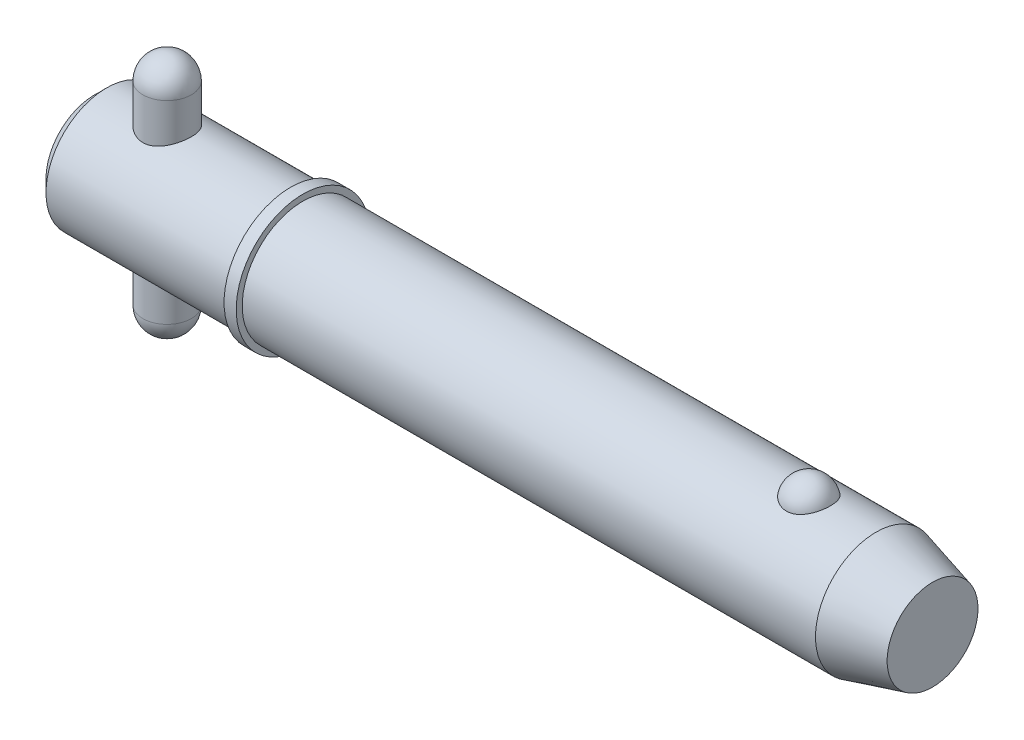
ISO-10303-21;
HEADER;
FILE_DESCRIPTION(('STEP AP214'),'2;1');
FILE_NAME('part.step','',(''),(''),'','','');
FILE_SCHEMA(('AUTOMOTIVE_DESIGN { 1 0 10303 214 1 1 1 1 }'));
ENDSEC;
DATA;
#1=APPLICATION_CONTEXT('core data for automotive mechanical design processes');
#2=APPLICATION_PROTOCOL_DEFINITION('international standard','automotive_design',2000,#1);
#3=PRODUCT_CONTEXT('',#1,'mechanical');
#4=PRODUCT('Part','Part','',(#3));
#5=PRODUCT_RELATED_PRODUCT_CATEGORY('part','',(#4));
#6=PRODUCT_DEFINITION_FORMATION('','',#4);
#7=PRODUCT_DEFINITION_CONTEXT('part definition',#1,'design');
#8=PRODUCT_DEFINITION('design','',#6,#7);
#9=PRODUCT_DEFINITION_SHAPE('','',#8);
#10=(LENGTH_UNIT() NAMED_UNIT(*) SI_UNIT(.MILLI.,.METRE.));
#11=(NAMED_UNIT(*) PLANE_ANGLE_UNIT() SI_UNIT($,.RADIAN.));
#12=(NAMED_UNIT(*) SI_UNIT($,.STERADIAN.) SOLID_ANGLE_UNIT());
#13=UNCERTAINTY_MEASURE_WITH_UNIT(LENGTH_MEASURE(1.E-05),#10,'distance_accuracy_value','');
#14=(GEOMETRIC_REPRESENTATION_CONTEXT(3) GLOBAL_UNCERTAINTY_ASSIGNED_CONTEXT((#13)) GLOBAL_UNIT_ASSIGNED_CONTEXT((#10,
#11,#12)) REPRESENTATION_CONTEXT('',''));
#15=CARTESIAN_POINT('',(0.,0.,0.));
#16=DIRECTION('',(0.,0.,1.));
#17=DIRECTION('',(1.,0.,0.));
#18=AXIS2_PLACEMENT_3D('',#15,#16,#17);
#19=CARTESIAN_POINT('',(9.525,15.875,0.));
#20=DIRECTION('',(0.,-1.,0.));
#21=DIRECTION('',(0.,0.,-1.));
#22=AXIS2_PLACEMENT_3D('',#19,#20,#21);
#23=CYLINDRICAL_SURFACE('',#22,3.175);
#24=CARTESIAN_POINT('',(9.525,-12.7,0.));
#25=DIRECTION('',(0.,-1.,0.));
#26=DIRECTION('',(0.,0.,-1.));
#27=AXIS2_PLACEMENT_3D('',#24,#25,#26);
#28=CIRCLE('',#27,3.175);
#29=CARTESIAN_POINT('',(9.525,-12.7,-3.175));
#30=VERTEX_POINT('',#29);
#31=EDGE_CURVE('P0_E10',#30,#30,#28,.F.);
#32=ORIENTED_EDGE('',*,*,#31,.T.);
#33=EDGE_LOOP('',(#32));
#34=FACE_BOUND('',#33,.T.);
#35=CARTESIAN_POINT('',(9.525,12.7,0.));
#36=DIRECTION('',(0.,-1.,0.));
#37=DIRECTION('',(0.,0.,-1.));
#38=AXIS2_PLACEMENT_3D('',#35,#36,#37);
#39=CIRCLE('',#38,3.175);
#40=CARTESIAN_POINT('',(9.525,12.7,-3.175));
#41=VERTEX_POINT('',#40);
#42=EDGE_CURVE('P0_E21',#41,#41,#39,.T.);
#43=ORIENTED_EDGE('',*,*,#42,.T.);
#44=EDGE_LOOP('',(#43));
#45=FACE_BOUND('',#44,.T.);
#46=ADVANCED_FACE('P0_F14',(#34,#45),#23,.T.);
#47=CARTESIAN_POINT('',(9.525,-12.7,0.));
#48=DIRECTION('',(0.,0.,1.));
#49=DIRECTION('',(1.,0.,0.));
#50=AXIS2_PLACEMENT_3D('',#47,#48,#49);
#51=SPHERICAL_SURFACE('',#50,3.175);
#52=CARTESIAN_POINT('',(9.525,-12.7,0.));
#53=DIRECTION('',(0.,-1.,0.));
#54=DIRECTION('',(0.,0.,-1.));
#55=AXIS2_PLACEMENT_3D('',#52,#53,#54);
#56=SPHERICAL_SURFACE('',#55,3.175);
#57=ORIENTED_EDGE('',*,*,#31,.F.);
#58=EDGE_LOOP('',(#57));
#59=FACE_BOUND('',#58,.T.);
#60=ADVANCED_FACE('P0_F29',(#59),#56,.T.);
#61=CARTESIAN_POINT('',(9.525,12.7,0.));
#62=DIRECTION('',(0.,0.,1.));
#63=DIRECTION('',(1.,0.,0.));
#64=AXIS2_PLACEMENT_3D('',#61,#62,#63);
#65=SPHERICAL_SURFACE('',#64,3.175);
#66=CARTESIAN_POINT('',(9.525,12.7,0.));
#67=DIRECTION('',(0.,-1.,0.));
#68=DIRECTION('',(0.,0.,-1.));
#69=AXIS2_PLACEMENT_3D('',#66,#67,#68);
#70=SPHERICAL_SURFACE('',#69,3.175);
#71=ORIENTED_EDGE('',*,*,#42,.F.);
#72=EDGE_LOOP('',(#71));
#73=FACE_BOUND('',#72,.T.);
#74=ADVANCED_FACE('P0_F16',(#73),#70,.T.);
#75=CLOSED_SHELL('',(#46,#60,#74));
#76=MANIFOLD_SOLID_BREP('P0_B1',#75);
#77=CARTESIAN_POINT('',(0.,0.,0.));
#78=DIRECTION('',(1.,0.,0.));
#79=DIRECTION('',(0.,0.,-1.));
#80=AXIS2_PLACEMENT_3D('',#77,#78,#79);
#81=CYLINDRICAL_SURFACE('',#80,7.94);
#82=CARTESIAN_POINT('',(102.451879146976,0.,0.));
#83=DIRECTION('',(1.,0.,0.));
#84=DIRECTION('',(0.,0.,-1.));
#85=AXIS2_PLACEMENT_3D('',#82,#83,#84);
#86=CIRCLE('',#85,7.94);
#87=CARTESIAN_POINT('',(102.451879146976,0.,-7.94));
#88=VERTEX_POINT('',#87);
#89=EDGE_CURVE('P1_E81',#88,#88,#86,.T.);
#90=ORIENTED_EDGE('',*,*,#89,.F.);
#91=EDGE_LOOP('',(#90));
#92=FACE_BOUND('',#91,.T.);
#93=CARTESIAN_POINT('',(27.31,0.,0.));
#94=DIRECTION('',(1.,0.,0.));
#95=DIRECTION('',(0.,0.,-1.));
#96=AXIS2_PLACEMENT_3D('',#93,#94,#95);
#97=CIRCLE('',#96,7.94);
#98=CARTESIAN_POINT('',(27.31,0.,-7.94));
#99=VERTEX_POINT('',#98);
#100=EDGE_CURVE('P1_E85',#99,#99,#97,.T.);
#101=ORIENTED_EDGE('',*,*,#100,.T.);
#102=EDGE_LOOP('',(#101));
#103=FACE_BOUND('',#102,.T.);
#104=CARTESIAN_POINT('',(93.6449074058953,7.37767842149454,2.93486986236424));
#105=CARTESIAN_POINT('',(93.4927496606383,7.37767329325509,2.9348750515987));
#106=CARTESIAN_POINT('',(93.3406329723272,7.38258419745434,2.92262454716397));
#107=CARTESIAN_POINT('',(93.0409284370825,7.40163229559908,2.87404196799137));
#108=CARTESIAN_POINT('',(92.8933394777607,7.41576720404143,2.83771585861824));
#109=CARTESIAN_POINT('',(92.6070187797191,7.45161576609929,2.74218769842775));
#110=CARTESIAN_POINT('',(92.4682745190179,7.47331841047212,2.68301886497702));
#111=CARTESIAN_POINT('',(92.2028822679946,7.52194082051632,2.54350967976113));
#112=CARTESIAN_POINT('',(92.0762366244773,7.54886159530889,2.46316523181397));
#113=CARTESIAN_POINT('',(91.8345349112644,7.60594671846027,2.28090375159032));
#114=CARTESIAN_POINT('',(91.7199065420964,7.63618114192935,2.1784421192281));
#115=CARTESIAN_POINT('',(91.5088787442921,7.69614046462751,1.95608495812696));
#116=CARTESIAN_POINT('',(91.4124826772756,7.72586526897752,1.83618622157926));
#117=CARTESIAN_POINT('',(91.2359381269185,7.78314821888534,1.57628086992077));
#118=CARTESIAN_POINT('',(91.1567072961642,7.81055035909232,1.43561546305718));
#119=CARTESIAN_POINT('',(91.0217979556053,7.85879631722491,1.14236334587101));
#120=CARTESIAN_POINT('',(90.9661216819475,7.87963951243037,0.98977550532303));
#121=CARTESIAN_POINT('',(90.8788121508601,7.91289645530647,0.674619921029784));
#122=CARTESIAN_POINT('',(90.8475309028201,7.92518652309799,0.511941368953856));
#123=CARTESIAN_POINT('',(90.8109756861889,7.93958930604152,0.18324773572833));
#124=CARTESIAN_POINT('',(90.8057012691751,7.94170219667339,0.0172327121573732));
#125=CARTESIAN_POINT('',(90.8212311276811,7.93554931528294,-0.312672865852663));
#126=CARTESIAN_POINT('',(90.8419253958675,7.92732732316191,-0.476569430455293));
#127=CARTESIAN_POINT('',(90.9087865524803,7.90141534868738,-0.798305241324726));
#128=CARTESIAN_POINT('',(90.9549539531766,7.88372517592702,-0.95614436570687));
#129=CARTESIAN_POINT('',(91.0718986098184,7.84066230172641,-1.26152073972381));
#130=CARTESIAN_POINT('',(91.1427046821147,7.81528060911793,-1.40904568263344));
#131=CARTESIAN_POINT('',(91.3074789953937,7.7594867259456,-1.68950598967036));
#132=CARTESIAN_POINT('',(91.4014488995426,7.72907417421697,-1.82244030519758));
#133=CARTESIAN_POINT('',(91.6108391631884,7.66640424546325,-2.07032792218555));
#134=CARTESIAN_POINT('',(91.7263152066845,7.63414223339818,-2.1852330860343));
#135=CARTESIAN_POINT('',(91.9759006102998,7.57149681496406,-2.39329737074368));
#136=CARTESIAN_POINT('',(92.1100080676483,7.54111321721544,-2.48645870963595));
#137=CARTESIAN_POINT('',(92.3901113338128,7.48650742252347,-2.64628132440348));
#138=CARTESIAN_POINT('',(92.5357605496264,7.46215900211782,-2.71350554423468));
#139=CARTESIAN_POINT('',(92.8374259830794,7.42171253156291,-2.82226614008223));
#140=CARTESIAN_POINT('',(92.9934383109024,7.40561140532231,-2.86381209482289));
#141=CARTESIAN_POINT('',(93.3029708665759,7.3842679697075,-2.91839077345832));
#142=CARTESIAN_POINT('',(93.4562229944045,7.37852109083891,-2.93275024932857));
#143=CARTESIAN_POINT('',(93.7630705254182,7.37700973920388,-2.93655208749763));
#144=CARTESIAN_POINT('',(93.9166658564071,7.38124333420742,-2.92599927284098));
#145=CARTESIAN_POINT('',(94.2149907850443,7.39890635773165,-2.88102897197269));
#146=CARTESIAN_POINT('',(94.3598480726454,7.41205491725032,-2.84733999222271));
#147=CARTESIAN_POINT('',(94.6416432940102,7.44580110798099,-2.75788206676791));
#148=CARTESIAN_POINT('',(94.7785805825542,7.46639934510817,-2.70211132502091));
#149=CARTESIAN_POINT('',(95.0440619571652,7.51339098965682,-2.56858908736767));
#150=CARTESIAN_POINT('',(95.1723548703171,7.5399020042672,-2.49038067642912));
#151=CARTESIAN_POINT('',(95.4142440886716,7.59569503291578,-2.31462737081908));
#152=CARTESIAN_POINT('',(95.5278370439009,7.6249776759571,-2.21707808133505));
#153=CARTESIAN_POINT('',(95.74322156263,7.68489473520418,-1.99982049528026));
#154=CARTESIAN_POINT('',(95.8441488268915,7.71552419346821,-1.87925337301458));
#155=CARTESIAN_POINT('',(96.0251866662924,7.77353016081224,-1.62268826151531));
#156=CARTESIAN_POINT('',(96.1052934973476,7.80090608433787,-1.48668750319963));
#157=CARTESIAN_POINT('',(96.2453615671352,7.85047992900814,-1.19818413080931));
#158=CARTESIAN_POINT('',(96.3045877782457,7.87248183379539,-1.04529016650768));
#159=CARTESIAN_POINT('',(96.3979821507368,7.90785114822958,-0.731080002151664));
#160=CARTESIAN_POINT('',(96.4321497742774,7.92121837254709,-0.569763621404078));
#161=CARTESIAN_POINT('',(96.474795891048,7.93797834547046,-0.24281228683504));
#162=CARTESIAN_POINT('',(96.4832047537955,7.94134405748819,-0.0771668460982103));
#163=CARTESIAN_POINT('',(96.4739626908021,7.93767937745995,0.253276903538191));
#164=CARTESIAN_POINT('',(96.4563120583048,7.93064910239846,0.418075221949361));
#165=CARTESIAN_POINT('',(96.395424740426,7.90695571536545,0.74152553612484));
#166=CARTESIAN_POINT('',(96.3522819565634,7.8903279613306,0.900197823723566));
#167=CARTESIAN_POINT('',(96.2413535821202,7.84916386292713,1.20759654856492));
#168=CARTESIAN_POINT('',(96.17356656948,7.82462706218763,1.35632241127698));
#169=CARTESIAN_POINT('',(96.0143718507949,7.7700669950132,1.64032869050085));
#170=CARTESIAN_POINT('',(95.9228616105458,7.74002008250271,1.7755471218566));
#171=CARTESIAN_POINT('',(95.7182960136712,7.67774175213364,2.02800648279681));
#172=CARTESIAN_POINT('',(95.6052410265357,7.64551037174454,2.14524772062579));
#173=CARTESIAN_POINT('',(95.3608318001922,7.58265895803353,2.35778002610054));
#174=CARTESIAN_POINT('',(95.2295833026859,7.55203092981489,2.45319004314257));
#175=CARTESIAN_POINT('',(94.951601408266,7.49579792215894,2.61999897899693));
#176=CARTESIAN_POINT('',(94.8048670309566,7.47019326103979,2.69139637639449));
#177=CARTESIAN_POINT('',(94.4929477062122,7.42622216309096,2.81053241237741));
#178=CARTESIAN_POINT('',(94.3272209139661,7.40825002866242,2.85700910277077));
#179=CARTESIAN_POINT('',(93.9892792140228,7.38398348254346,2.91916850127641));
#180=CARTESIAN_POINT('',(93.8170670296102,7.37768422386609,2.93486399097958));
#181=CARTESIAN_POINT('',(93.6449074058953,7.37767842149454,2.93486986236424));
#182=B_SPLINE_CURVE_WITH_KNOTS('',3,(#104,#105,#106,#107,#108,#109,#110,#111,#112,#113,#114,
#115,#116,#117,#118,#119,#120,#121,#122,#123,#124,#125,#126,#127,#128,#129,#130,#131,#132,#133,
#134,#135,#136,#137,#138,#139,#140,#141,#142,#143,#144,#145,#146,#147,#148,#149,#150,#151,#152,
#153,#154,#155,#156,#157,#158,#159,#160,#161,#162,#163,#164,#165,#166,#167,#168,#169,#170,#171,
#172,#173,#174,#175,#176,#177,#178,#179,#180,#181),.UNSPECIFIED.,.T.,.F.,(4,2,2,2,2,2,2,2,2,2,2,
2,2,2,2,2,2,2,2,2,2,2,2,2,2,2,2,2,2,2,2,2,2,2,2,2,2,2,4),(0.,0.455841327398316,
0.911569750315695,1.36663794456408,1.82179423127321,2.28978983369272,2.75787163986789,
3.24685368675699,3.73588214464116,4.23184282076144,4.72779494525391,5.22165321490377,
5.71552141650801,6.20996917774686,6.70445245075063,7.200234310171,7.69596557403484,
8.18023418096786,8.66432203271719,9.12410697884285,9.58380291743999,10.0296503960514,
10.475534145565,10.9312349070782,11.3870393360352,11.8654416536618,12.3439299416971,
12.8378875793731,13.3318558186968,13.8271581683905,14.3224549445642,14.8159385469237,
15.3094506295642,15.8051323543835,16.3008055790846,16.7937101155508,17.2866458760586,
17.8026240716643,18.3183879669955),.UNSPECIFIED.);
#183=CARTESIAN_POINT('',(93.6449074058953,7.37767842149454,2.93486986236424));
#184=VERTEX_POINT('',#183);
#185=EDGE_CURVE('P1_E35',#184,#184,#182,.T.);
#186=ORIENTED_EDGE('',*,*,#185,.T.);
#187=EDGE_LOOP('',(#186));
#188=FACE_BOUND('',#187,.T.);
#189=ADVANCED_FACE('P1_F13',(#92,#103,#188),#81,.T.);
#190=CARTESIAN_POINT('',(0.,0.,0.));
#191=DIRECTION('',(-1.,0.,0.));
#192=DIRECTION('',(0.,0.,1.));
#193=AXIS2_PLACEMENT_3D('',#190,#191,#192);
#194=PLANE('',#193);
#195=CARTESIAN_POINT('',(0.,0.,0.));
#196=DIRECTION('',(1.,0.,0.));
#197=DIRECTION('',(0.,0.,-1.));
#198=AXIS2_PLACEMENT_3D('',#195,#196,#197);
#199=CIRCLE('',#198,6.352);
#200=CARTESIAN_POINT('',(0.,0.,-6.352));
#201=VERTEX_POINT('',#200);
#202=EDGE_CURVE('P1_E9',#201,#201,#199,.T.);
#203=ORIENTED_EDGE('',*,*,#202,.F.);
#204=EDGE_LOOP('',(#203));
#205=FACE_BOUND('',#204,.T.);
#206=ADVANCED_FACE('P1_F15',(#205),#194,.T.);
#207=CARTESIAN_POINT('',(1.58799999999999,0.,0.));
#208=DIRECTION('',(1.,0.,0.));
#209=DIRECTION('',(0.,0.,-1.));
#210=AXIS2_PLACEMENT_3D('',#207,#208,#209);
#211=CONICAL_SURFACE('',#210,7.94,0.78539816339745);
#212=ORIENTED_EDGE('',*,*,#202,.T.);
#213=EDGE_LOOP('',(#212));
#214=FACE_BOUND('',#213,.T.);
#215=CARTESIAN_POINT('',(1.58799999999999,0.,0.));
#216=DIRECTION('',(1.,0.,0.));
#217=DIRECTION('',(0.,0.,-1.));
#218=AXIS2_PLACEMENT_3D('',#215,#216,#217);
#219=CIRCLE('',#218,7.94);
#220=CARTESIAN_POINT('',(1.58799999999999,0.,-7.94));
#221=VERTEX_POINT('',#220);
#222=EDGE_CURVE('P1_E26',#221,#221,#219,.T.);
#223=ORIENTED_EDGE('',*,*,#222,.F.);
#224=EDGE_LOOP('',(#223));
#225=FACE_BOUND('',#224,.T.);
#226=ADVANCED_FACE('P1_F77',(#214,#225),#211,.T.);
#227=CARTESIAN_POINT('',(0.,0.,0.));
#228=DIRECTION('',(1.,0.,0.));
#229=DIRECTION('',(0.,0.,-1.));
#230=AXIS2_PLACEMENT_3D('',#227,#228,#229);
#231=CYLINDRICAL_SURFACE('',#230,7.94);
#232=CARTESIAN_POINT('',(9.525,-7.27756655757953,3.175));
#233=CARTESIAN_POINT('',(9.43992346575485,-7.27756715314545,3.17499935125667));
#234=CARTESIAN_POINT('',(9.35481882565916,-7.27906496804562,3.1715736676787));
#235=CARTESIAN_POINT('',(9.18524505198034,-7.28499816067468,3.15791803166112));
#236=CARTESIAN_POINT('',(9.100776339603,-7.28943533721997,3.14768391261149));
#237=CARTESIAN_POINT('',(8.84895715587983,-7.30698881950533,3.10684226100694));
#238=CARTESIAN_POINT('',(8.6834173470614,-7.32434654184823,3.06609574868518));
#239=CARTESIAN_POINT('',(8.36278910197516,-7.36806950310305,2.95945910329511));
#240=CARTESIAN_POINT('',(8.20766386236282,-7.39440078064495,2.89366366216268));
#241=CARTESIAN_POINT('',(7.91065319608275,-7.45304562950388,2.73907413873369));
#242=CARTESIAN_POINT('',(7.76876488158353,-7.48535789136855,2.65028508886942));
#243=CARTESIAN_POINT('',(7.49411086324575,-7.55439482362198,2.44679888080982));
#244=CARTESIAN_POINT('',(7.36219910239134,-7.59126138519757,2.33099745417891));
#245=CARTESIAN_POINT('',(7.11904234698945,-7.66408045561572,2.07909838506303));
#246=CARTESIAN_POINT('',(7.00780457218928,-7.70003264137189,1.94299368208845));
#247=CARTESIAN_POINT('',(6.80492173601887,-7.76867514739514,1.64775981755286));
#248=CARTESIAN_POINT('',(6.71422139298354,-7.80118112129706,1.48793473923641));
#249=CARTESIAN_POINT('',(6.56135788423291,-7.85754918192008,1.15376269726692));
#250=CARTESIAN_POINT('',(6.49918311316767,-7.88141478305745,0.979421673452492));
#251=CARTESIAN_POINT('',(6.40818142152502,-7.91680873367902,0.630115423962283));
#252=CARTESIAN_POINT('',(6.3778864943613,-7.9288781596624,0.455588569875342));
#253=CARTESIAN_POINT('',(6.34677743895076,-7.94127547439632,0.103539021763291));
#254=CARTESIAN_POINT('',(6.34595232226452,-7.94160773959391,-0.0739825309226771));
#255=CARTESIAN_POINT('',(6.37300128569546,-7.93082261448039,-0.416371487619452));
#256=CARTESIAN_POINT('',(6.39926693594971,-7.92034690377,-0.581389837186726));
#257=CARTESIAN_POINT('',(6.47701615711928,-7.88998770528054,-0.904449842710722));
#258=CARTESIAN_POINT('',(6.52850157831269,-7.87010352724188,-1.06249098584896));
#259=CARTESIAN_POINT('',(6.65586120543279,-7.82249343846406,-1.36995769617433));
#260=CARTESIAN_POINT('',(6.73209124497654,-7.79465387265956,-1.51921754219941));
#261=CARTESIAN_POINT('',(6.90644286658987,-7.73389606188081,-1.80321183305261));
#262=CARTESIAN_POINT('',(7.00457194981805,-7.70097607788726,-1.93794127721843));
#263=CARTESIAN_POINT('',(7.22744086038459,-7.63084889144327,-2.19843606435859));
#264=CARTESIAN_POINT('',(7.35350432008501,-7.59350211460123,-2.3230330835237));
#265=CARTESIAN_POINT('',(7.62488266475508,-7.52039654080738,-2.54979642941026));
#266=CARTESIAN_POINT('',(7.77020381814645,-7.48463826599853,-2.65195542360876));
#267=CARTESIAN_POINT('',(8.08119298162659,-7.41780943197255,-2.83361305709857));
#268=CARTESIAN_POINT('',(8.24731937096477,-7.38689959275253,-2.91239105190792));
#269=CARTESIAN_POINT('',(8.59204539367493,-7.33515216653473,-3.04038913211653));
#270=CARTESIAN_POINT('',(8.77063684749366,-7.31430804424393,-3.08962840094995));
#271=CARTESIAN_POINT('',(9.12356982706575,-7.28663831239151,-3.15431018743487));
#272=CARTESIAN_POINT('',(9.29750494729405,-7.2790344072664,-3.17163284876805));
#273=CARTESIAN_POINT('',(9.64592502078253,-7.27648884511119,-3.17747282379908));
#274=CARTESIAN_POINT('',(9.82040979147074,-7.28154335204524,-3.16599886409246));
#275=CARTESIAN_POINT('',(10.1545374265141,-7.30294638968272,-3.11628310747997));
#276=CARTESIAN_POINT('',(10.3144598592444,-7.31863587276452,-3.0796016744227));
#277=CARTESIAN_POINT('',(10.625774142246,-7.35872371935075,-2.98253618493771));
#278=CARTESIAN_POINT('',(10.7771640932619,-7.38312401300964,-2.92214687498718));
#279=CARTESIAN_POINT('',(11.0739599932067,-7.4390944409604,-2.77664664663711));
#280=CARTESIAN_POINT('',(11.2188745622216,-7.47091513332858,-2.69063278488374));
#281=CARTESIAN_POINT('',(11.4928722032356,-7.53775867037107,-2.49724834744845));
#282=CARTESIAN_POINT('',(11.6219487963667,-7.57278281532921,-2.38986907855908));
#283=CARTESIAN_POINT('',(11.8705091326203,-7.64520845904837,-2.1474449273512));
#284=CARTESIAN_POINT('',(11.9885816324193,-7.68259462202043,-2.01094304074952));
#285=CARTESIAN_POINT('',(12.2003631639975,-7.75309951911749,-1.71917041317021));
#286=CARTESIAN_POINT('',(12.2940712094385,-7.78621808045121,-1.56389891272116));
#287=CARTESIAN_POINT('',(12.4541161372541,-7.84456050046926,-1.23845027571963));
#288=CARTESIAN_POINT('',(12.5204600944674,-7.86978639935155,-1.06827700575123));
#289=CARTESIAN_POINT('',(12.6231407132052,-7.90943635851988,-0.717928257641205));
#290=CARTESIAN_POINT('',(12.6594936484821,-7.92386627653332,-0.537758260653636));
#291=CARTESIAN_POINT('',(12.6992281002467,-7.93967263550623,-0.185201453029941));
#292=CARTESIAN_POINT('',(12.7046050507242,-7.94183891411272,-0.0130732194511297));
#293=CARTESIAN_POINT('',(12.6875036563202,-7.9350072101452,0.329549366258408));
#294=CARTESIAN_POINT('',(12.6650295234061,-7.92601091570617,0.500043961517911));
#295=CARTESIAN_POINT('',(12.5942896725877,-7.89825976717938,0.829196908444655));
#296=CARTESIAN_POINT('',(12.5468364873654,-7.87981280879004,0.988057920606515));
#297=CARTESIAN_POINT('',(12.4283390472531,-7.83513565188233,1.29553461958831));
#298=CARTESIAN_POINT('',(12.3572904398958,-7.8089040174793,1.44414841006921));
#299=CARTESIAN_POINT('',(12.1900822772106,-7.7497911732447,1.73412879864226));
#300=CARTESIAN_POINT('',(12.0929519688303,-7.71666737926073,1.87488510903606));
#301=CARTESIAN_POINT('',(11.8777894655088,-7.64775894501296,2.13869231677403));
#302=CARTESIAN_POINT('',(11.7597486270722,-7.61197320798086,2.26173585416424));
#303=CARTESIAN_POINT('',(11.4974896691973,-7.53902341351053,2.49449755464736));
#304=CARTESIAN_POINT('',(11.3521039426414,-7.50191102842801,2.60292060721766));
#305=CARTESIAN_POINT('',(11.0440201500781,-7.43289551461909,2.79392602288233));
#306=CARTESIAN_POINT('',(10.8813200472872,-7.40099299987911,2.87650534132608));
#307=CARTESIAN_POINT('',(10.558064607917,-7.3489506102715,3.00682739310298));
#308=CARTESIAN_POINT('',(10.398627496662,-7.32801197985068,3.05703164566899));
#309=CARTESIAN_POINT('',(10.0731242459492,-7.29639491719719,3.13175843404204));
#310=CARTESIAN_POINT('',(9.90707793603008,-7.28568789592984,3.15635254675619));
#311=CARTESIAN_POINT('',(9.70441566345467,-7.27968826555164,3.17013149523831));
#312=CARTESIAN_POINT('',(9.66856669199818,-7.27889378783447,3.17195593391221));
#313=CARTESIAN_POINT('',(9.59681348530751,-7.27783278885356,3.17439036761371));
#314=CARTESIAN_POINT('',(9.56090924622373,-7.27756630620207,3.17500027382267));
#315=CARTESIAN_POINT('',(9.525,-7.27756655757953,3.175));
#316=B_SPLINE_CURVE_WITH_KNOTS('',3,(#232,#233,#234,#235,#236,#237,#238,#239,#240,#241,#242,
#243,#244,#245,#246,#247,#248,#249,#250,#251,#252,#253,#254,#255,#256,#257,#258,#259,#260,#261,
#262,#263,#264,#265,#266,#267,#268,#269,#270,#271,#272,#273,#274,#275,#276,#277,#278,#279,#280,
#281,#282,#283,#284,#285,#286,#287,#288,#289,#290,#291,#292,#293,#294,#295,#296,#297,#298,#299,
#300,#301,#302,#303,#304,#305,#306,#307,#308,#309,#310,#311,#312,#313,#314,#315),.UNSPECIFIED.,
.T.,.F.,(4,2,2,2,2,2,2,2,2,2,2,2,2,2,2,2,2,2,2,2,2,2,2,2,2,2,2,2,2,2,2,2,2,2,2,2,2,2,2,2,2,4),
(0.,0.255187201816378,0.510530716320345,1.0218798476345,1.53131482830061,2.04063840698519,
2.57635929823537,3.11226692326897,3.66929090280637,4.22608806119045,4.75594400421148,
5.28560237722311,5.78552836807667,6.28549104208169,6.79298787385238,7.30065880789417,
7.8416422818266,8.38280228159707,8.93923025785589,9.49529647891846,10.0174074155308,
10.5393601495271,11.0316114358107,11.5239718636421,12.0362920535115,12.5488211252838,
13.0991799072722,13.6495609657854,14.1997996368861,14.7497395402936,15.2638187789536,
15.7778202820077,16.2760504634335,16.7743726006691,17.294711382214,17.8152657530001,
18.3680208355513,18.9208410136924,19.4240423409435,19.9258334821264,20.0335354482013,
20.1412452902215),.UNSPECIFIED.);
#317=CARTESIAN_POINT('',(9.525,-7.27756655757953,3.175));
#318=VERTEX_POINT('',#317);
#319=EDGE_CURVE('P1_E17',#318,#318,#316,.T.);
#320=ORIENTED_EDGE('',*,*,#319,.F.);
#321=EDGE_LOOP('',(#320));
#322=FACE_BOUND('',#321,.T.);
#323=CARTESIAN_POINT('',(9.525,7.27756655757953,3.175));
#324=CARTESIAN_POINT('',(9.61007653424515,7.27756715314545,3.17499935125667));
#325=CARTESIAN_POINT('',(9.69518117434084,7.27906496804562,3.1715736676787));
#326=CARTESIAN_POINT('',(9.86475494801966,7.28499816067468,3.15791803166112));
#327=CARTESIAN_POINT('',(9.949223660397,7.28943533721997,3.14768391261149));
#328=CARTESIAN_POINT('',(10.2010428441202,7.30698881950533,3.10684226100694));
#329=CARTESIAN_POINT('',(10.3665826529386,7.32434654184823,3.06609574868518));
#330=CARTESIAN_POINT('',(10.6872108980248,7.36806950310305,2.95945910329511));
#331=CARTESIAN_POINT('',(10.8423361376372,7.39440078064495,2.89366366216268));
#332=CARTESIAN_POINT('',(11.1393468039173,7.45304562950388,2.73907413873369));
#333=CARTESIAN_POINT('',(11.2812351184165,7.48535789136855,2.65028508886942));
#334=CARTESIAN_POINT('',(11.5558891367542,7.55439482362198,2.44679888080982));
#335=CARTESIAN_POINT('',(11.6878008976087,7.59126138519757,2.33099745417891));
#336=CARTESIAN_POINT('',(11.9309576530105,7.66408045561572,2.07909838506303));
#337=CARTESIAN_POINT('',(12.0421954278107,7.70003264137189,1.94299368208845));
#338=CARTESIAN_POINT('',(12.2450782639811,7.76867514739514,1.64775981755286));
#339=CARTESIAN_POINT('',(12.3357786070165,7.80118112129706,1.48793473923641));
#340=CARTESIAN_POINT('',(12.4886421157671,7.85754918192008,1.15376269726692));
#341=CARTESIAN_POINT('',(12.5508168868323,7.88141478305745,0.979421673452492));
#342=CARTESIAN_POINT('',(12.641818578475,7.91680873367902,0.630115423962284));
#343=CARTESIAN_POINT('',(12.6721135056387,7.9288781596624,0.455588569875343));
#344=CARTESIAN_POINT('',(12.7032225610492,7.94127547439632,0.103539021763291));
#345=CARTESIAN_POINT('',(12.7040476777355,7.94160773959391,-0.0739825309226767));
#346=CARTESIAN_POINT('',(12.6769987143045,7.93082261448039,-0.416371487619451));
#347=CARTESIAN_POINT('',(12.6507330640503,7.92034690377,-0.581389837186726));
#348=CARTESIAN_POINT('',(12.5729838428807,7.88998770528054,-0.904449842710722));
#349=CARTESIAN_POINT('',(12.5214984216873,7.87010352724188,-1.06249098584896));
#350=CARTESIAN_POINT('',(12.3941387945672,7.82249343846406,-1.36995769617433));
#351=CARTESIAN_POINT('',(12.3179087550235,7.79465387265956,-1.51921754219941));
#352=CARTESIAN_POINT('',(12.1435571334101,7.73389606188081,-1.80321183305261));
#353=CARTESIAN_POINT('',(12.0454280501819,7.70097607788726,-1.93794127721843));
#354=CARTESIAN_POINT('',(11.8225591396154,7.63084889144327,-2.19843606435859));
#355=CARTESIAN_POINT('',(11.696495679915,7.59350211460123,-2.3230330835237));
#356=CARTESIAN_POINT('',(11.4251173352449,7.52039654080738,-2.54979642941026));
#357=CARTESIAN_POINT('',(11.2797961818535,7.48463826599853,-2.65195542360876));
#358=CARTESIAN_POINT('',(10.9688070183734,7.41780943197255,-2.83361305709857));
#359=CARTESIAN_POINT('',(10.8026806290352,7.38689959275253,-2.91239105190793));
#360=CARTESIAN_POINT('',(10.4579546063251,7.33515216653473,-3.04038913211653));
#361=CARTESIAN_POINT('',(10.2793631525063,7.31430804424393,-3.08962840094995));
#362=CARTESIAN_POINT('',(9.92643017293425,7.28663831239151,-3.15431018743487));
#363=CARTESIAN_POINT('',(9.75249505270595,7.2790344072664,-3.17163284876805));
#364=CARTESIAN_POINT('',(9.40407497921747,7.2764888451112,-3.17747282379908));
#365=CARTESIAN_POINT('',(9.22959020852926,7.28154335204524,-3.16599886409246));
#366=CARTESIAN_POINT('',(8.89546257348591,7.30294638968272,-3.11628310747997));
#367=CARTESIAN_POINT('',(8.73554014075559,7.31863587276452,-3.0796016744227));
#368=CARTESIAN_POINT('',(8.42422585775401,7.35872371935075,-2.98253618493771));
#369=CARTESIAN_POINT('',(8.27283590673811,7.38312401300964,-2.92214687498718));
#370=CARTESIAN_POINT('',(7.97604000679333,7.4390944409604,-2.77664664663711));
#371=CARTESIAN_POINT('',(7.83112543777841,7.47091513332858,-2.69063278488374));
#372=CARTESIAN_POINT('',(7.55712779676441,7.53775867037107,-2.49724834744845));
#373=CARTESIAN_POINT('',(7.42805120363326,7.57278281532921,-2.38986907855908));
#374=CARTESIAN_POINT('',(7.17949086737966,7.64520845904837,-2.1474449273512));
#375=CARTESIAN_POINT('',(7.06141836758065,7.68259462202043,-2.01094304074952));
#376=CARTESIAN_POINT('',(6.8496368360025,7.75309951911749,-1.71917041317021));
#377=CARTESIAN_POINT('',(6.75592879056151,7.78621808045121,-1.56389891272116));
#378=CARTESIAN_POINT('',(6.59588386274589,7.84456050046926,-1.23845027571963));
#379=CARTESIAN_POINT('',(6.52953990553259,7.86978639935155,-1.06827700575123));
#380=CARTESIAN_POINT('',(6.42685928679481,7.90943635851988,-0.717928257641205));
#381=CARTESIAN_POINT('',(6.39050635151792,7.92386627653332,-0.537758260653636));
#382=CARTESIAN_POINT('',(6.35077189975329,7.93967263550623,-0.18520145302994));
#383=CARTESIAN_POINT('',(6.34539494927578,7.94183891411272,-0.0130732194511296));
#384=CARTESIAN_POINT('',(6.36249634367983,7.9350072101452,0.329549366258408));
#385=CARTESIAN_POINT('',(6.38497047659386,7.92601091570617,0.500043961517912));
#386=CARTESIAN_POINT('',(6.45571032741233,7.89825976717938,0.829196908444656));
#387=CARTESIAN_POINT('',(6.50316351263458,7.87981280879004,0.988057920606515));
#388=CARTESIAN_POINT('',(6.62166095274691,7.83513565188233,1.29553461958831));
#389=CARTESIAN_POINT('',(6.69270956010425,7.8089040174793,1.44414841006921));
#390=CARTESIAN_POINT('',(6.85991772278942,7.7497911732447,1.73412879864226));
#391=CARTESIAN_POINT('',(6.95704803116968,7.71666737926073,1.87488510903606));
#392=CARTESIAN_POINT('',(7.17221053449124,7.64775894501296,2.13869231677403));
#393=CARTESIAN_POINT('',(7.29025137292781,7.61197320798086,2.26173585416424));
#394=CARTESIAN_POINT('',(7.55251033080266,7.53902341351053,2.49449755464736));
#395=CARTESIAN_POINT('',(7.69789605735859,7.50191102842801,2.60292060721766));
#396=CARTESIAN_POINT('',(8.00597984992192,7.43289551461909,2.79392602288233));
#397=CARTESIAN_POINT('',(8.16867995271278,7.40099299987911,2.87650534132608));
#398=CARTESIAN_POINT('',(8.49193539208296,7.3489506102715,3.00682739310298));
#399=CARTESIAN_POINT('',(8.65137250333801,7.32801197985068,3.05703164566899));
#400=CARTESIAN_POINT('',(8.97687575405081,7.29639491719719,3.13175843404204));
#401=CARTESIAN_POINT('',(9.14292206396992,7.28568789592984,3.15635254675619));
#402=CARTESIAN_POINT('',(9.34558433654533,7.27968826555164,3.17013149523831));
#403=CARTESIAN_POINT('',(9.38143330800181,7.27889378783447,3.17195593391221));
#404=CARTESIAN_POINT('',(9.45318651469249,7.27783278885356,3.17439036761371));
#405=CARTESIAN_POINT('',(9.48909075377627,7.27756630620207,3.17500027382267));
#406=CARTESIAN_POINT('',(9.525,7.27756655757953,3.175));
#407=B_SPLINE_CURVE_WITH_KNOTS('',3,(#323,#324,#325,#326,#327,#328,#329,#330,#331,#332,#333,
#334,#335,#336,#337,#338,#339,#340,#341,#342,#343,#344,#345,#346,#347,#348,#349,#350,#351,#352,
#353,#354,#355,#356,#357,#358,#359,#360,#361,#362,#363,#364,#365,#366,#367,#368,#369,#370,#371,
#372,#373,#374,#375,#376,#377,#378,#379,#380,#381,#382,#383,#384,#385,#386,#387,#388,#389,#390,
#391,#392,#393,#394,#395,#396,#397,#398,#399,#400,#401,#402,#403,#404,#405,#406),.UNSPECIFIED.,
.T.,.F.,(4,2,2,2,2,2,2,2,2,2,2,2,2,2,2,2,2,2,2,2,2,2,2,2,2,2,2,2,2,2,2,2,2,2,2,2,2,2,2,2,2,4),
(0.,0.255187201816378,0.510530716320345,1.0218798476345,1.53131482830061,2.04063840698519,
2.57635929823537,3.11226692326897,3.66929090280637,4.22608806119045,4.75594400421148,
5.2856023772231,5.78552836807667,6.28549104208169,6.79298787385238,7.30065880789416,
7.8416422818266,8.38280228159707,8.9392302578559,9.49529647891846,10.0174074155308,
10.5393601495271,11.0316114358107,11.5239718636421,12.0362920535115,12.5488211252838,
13.0991799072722,13.6495609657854,14.1997996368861,14.7497395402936,15.2638187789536,
15.7778202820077,16.2760504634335,16.7743726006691,17.294711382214,17.8152657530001,
18.3680208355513,18.9208410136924,19.4240423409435,19.9258334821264,20.0335354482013,
20.1412452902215),.UNSPECIFIED.);
#408=CARTESIAN_POINT('',(9.525,7.27756655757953,3.175));
#409=VERTEX_POINT('',#408);
#410=EDGE_CURVE('P1_E43',#409,#409,#407,.T.);
#411=ORIENTED_EDGE('',*,*,#410,.F.);
#412=EDGE_LOOP('',(#411));
#413=FACE_BOUND('',#412,.T.);
#414=ORIENTED_EDGE('',*,*,#222,.T.);
#415=EDGE_LOOP('',(#414));
#416=FACE_BOUND('',#415,.T.);
#417=CARTESIAN_POINT('',(25.722,0.,0.));
#418=DIRECTION('',(1.,0.,0.));
#419=DIRECTION('',(0.,0.,-1.));
#420=AXIS2_PLACEMENT_3D('',#417,#418,#419);
#421=CIRCLE('',#420,7.94);
#422=CARTESIAN_POINT('',(25.722,0.,-7.94));
#423=VERTEX_POINT('',#422);
#424=EDGE_CURVE('P1_E31',#423,#423,#421,.T.);
#425=ORIENTED_EDGE('',*,*,#424,.F.);
#426=EDGE_LOOP('',(#425));
#427=FACE_BOUND('',#426,.T.);
#428=ADVANCED_FACE('P1_F103',(#322,#413,#416,#427),#231,.T.);
#429=CARTESIAN_POINT('',(25.722,7.94,0.));
#430=DIRECTION('',(-1.,0.,0.));
#431=DIRECTION('',(0.,0.,1.));
#432=AXIS2_PLACEMENT_3D('',#429,#430,#431);
#433=PLANE('',#432);
#434=ORIENTED_EDGE('',*,*,#424,.T.);
#435=EDGE_LOOP('',(#434));
#436=FACE_BOUND('',#435,.T.);
#437=CARTESIAN_POINT('',(25.722,0.,0.));
#438=DIRECTION('',(1.,0.,0.));
#439=DIRECTION('',(0.,0.,-1.));
#440=AXIS2_PLACEMENT_3D('',#437,#438,#439);
#441=CIRCLE('',#440,8.734);
#442=CARTESIAN_POINT('',(25.722,0.,-8.734));
#443=VERTEX_POINT('',#442);
#444=EDGE_CURVE('P1_E91',#443,#443,#441,.T.);
#445=ORIENTED_EDGE('',*,*,#444,.F.);
#446=EDGE_LOOP('',(#445));
#447=FACE_BOUND('',#446,.T.);
#448=ADVANCED_FACE('P1_F100',(#436,#447),#433,.T.);
#449=CARTESIAN_POINT('',(0.,0.,0.));
#450=DIRECTION('',(1.,0.,0.));
#451=DIRECTION('',(0.,0.,-1.));
#452=AXIS2_PLACEMENT_3D('',#449,#450,#451);
#453=CYLINDRICAL_SURFACE('',#452,8.734);
#454=ORIENTED_EDGE('',*,*,#444,.T.);
#455=EDGE_LOOP('',(#454));
#456=FACE_BOUND('',#455,.T.);
#457=CARTESIAN_POINT('',(27.31,0.,0.));
#458=DIRECTION('',(1.,0.,0.));
#459=DIRECTION('',(0.,0.,-1.));
#460=AXIS2_PLACEMENT_3D('',#457,#458,#459);
#461=CIRCLE('',#460,8.734);
#462=CARTESIAN_POINT('',(27.31,0.,-8.734));
#463=VERTEX_POINT('',#462);
#464=EDGE_CURVE('P1_E88',#463,#463,#461,.T.);
#465=ORIENTED_EDGE('',*,*,#464,.F.);
#466=EDGE_LOOP('',(#465));
#467=FACE_BOUND('',#466,.T.);
#468=ADVANCED_FACE('P1_F68',(#456,#467),#453,.T.);
#469=CARTESIAN_POINT('',(27.31,8.734,0.));
#470=DIRECTION('',(1.,0.,0.));
#471=DIRECTION('',(0.,0.,-1.));
#472=AXIS2_PLACEMENT_3D('',#469,#470,#471);
#473=PLANE('',#472);
#474=ORIENTED_EDGE('',*,*,#464,.T.);
#475=EDGE_LOOP('',(#474));
#476=FACE_BOUND('',#475,.T.);
#477=ORIENTED_EDGE('',*,*,#100,.F.);
#478=EDGE_LOOP('',(#477));
#479=FACE_BOUND('',#478,.T.);
#480=ADVANCED_FACE('P1_F62',(#476,#479),#473,.T.);
#481=CARTESIAN_POINT('',(109.86,0.,0.));
#482=DIRECTION('',(-1.,0.,0.));
#483=DIRECTION('',(0.,0.,1.));
#484=AXIS2_PLACEMENT_3D('',#481,#482,#483);
#485=CONICAL_SURFACE('',#484,5.95500000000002,0.26179938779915);
#486=ORIENTED_EDGE('',*,*,#89,.T.);
#487=EDGE_LOOP('',(#486));
#488=FACE_BOUND('',#487,.T.);
#489=CARTESIAN_POINT('',(109.86,0.,0.));
#490=DIRECTION('',(1.,0.,0.));
#491=DIRECTION('',(0.,0.,-1.));
#492=AXIS2_PLACEMENT_3D('',#489,#490,#491);
#493=CIRCLE('',#492,5.95500000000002);
#494=CARTESIAN_POINT('',(109.86,0.,-5.95500000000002));
#495=VERTEX_POINT('',#494);
#496=EDGE_CURVE('P1_E42',#495,#495,#493,.T.);
#497=ORIENTED_EDGE('',*,*,#496,.F.);
#498=EDGE_LOOP('',(#497));
#499=FACE_BOUND('',#498,.T.);
#500=ADVANCED_FACE('P1_F59',(#488,#499),#485,.T.);
#501=CARTESIAN_POINT('',(109.86,5.95500000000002,0.));
#502=DIRECTION('',(1.,0.,0.));
#503=DIRECTION('',(0.,0.,-1.));
#504=AXIS2_PLACEMENT_3D('',#501,#502,#503);
#505=PLANE('',#504);
#506=ORIENTED_EDGE('',*,*,#496,.T.);
#507=EDGE_LOOP('',(#506));
#508=FACE_BOUND('',#507,.T.);
#509=ADVANCED_FACE('P1_F55',(#508),#505,.T.);
#510=CARTESIAN_POINT('',(93.6449074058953,7.146,0.));
#511=DIRECTION('',(-1.,0.,0.));
#512=DIRECTION('',(0.,1.,0.));
#513=AXIS2_PLACEMENT_3D('',#510,#511,#512);
#514=SPHERICAL_SURFACE('',#513,2.94400000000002);
#515=ORIENTED_EDGE('',*,*,#185,.F.);
#516=EDGE_LOOP('',(#515));
#517=FACE_BOUND('',#516,.T.);
#518=ADVANCED_FACE('P1_F50',(#517),#514,.T.);
#519=CARTESIAN_POINT('',(9.525,-8.734,0.));
#520=DIRECTION('',(0.,1.,0.));
#521=DIRECTION('',(0.,0.,1.));
#522=AXIS2_PLACEMENT_3D('',#519,#520,#521);
#523=CYLINDRICAL_SURFACE('',#522,3.175);
#524=ORIENTED_EDGE('',*,*,#319,.T.);
#525=EDGE_LOOP('',(#524));
#526=FACE_BOUND('',#525,.T.);
#527=ORIENTED_EDGE('',*,*,#410,.T.);
#528=EDGE_LOOP('',(#527));
#529=FACE_BOUND('',#528,.T.);
#530=ADVANCED_FACE('P1_F54',(#526,#529),#523,.F.);
#531=CLOSED_SHELL('',(#189,#206,#226,#428,#448,#468,#480,#500,#509,#518,#530));
#532=MANIFOLD_SOLID_BREP('P1_B1',#531);
#533=ADVANCED_BREP_SHAPE_REPRESENTATION('',(#18,#76,#532),#14);
#534=SHAPE_DEFINITION_REPRESENTATION(#9,#533);
ENDSEC;
END-ISO-10303-21;
